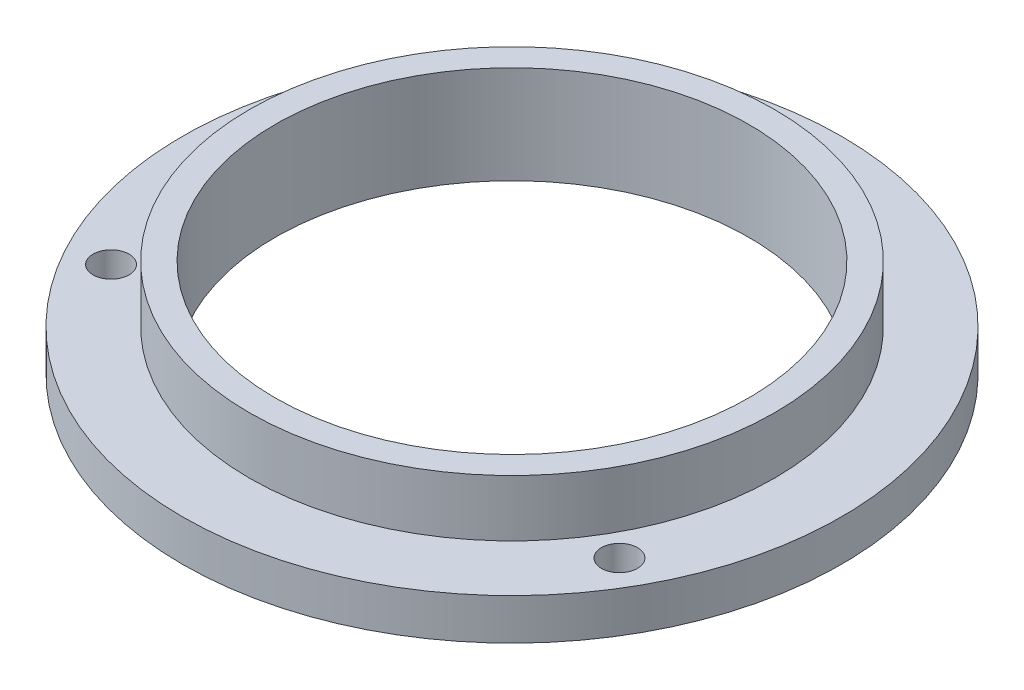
ISO-10303-21;
HEADER;
FILE_DESCRIPTION(('STEP AP214'),'2;1');
FILE_NAME('part.step','',(''),(''),'','','');
FILE_SCHEMA(('AUTOMOTIVE_DESIGN { 1 0 10303 214 1 1 1 1 }'));
ENDSEC;
DATA;
#1=APPLICATION_CONTEXT('core data for automotive mechanical design processes');
#2=APPLICATION_PROTOCOL_DEFINITION('international standard','automotive_design',2000,#1);
#3=PRODUCT_CONTEXT('',#1,'mechanical');
#4=PRODUCT('Part','Part','',(#3));
#5=PRODUCT_RELATED_PRODUCT_CATEGORY('part','',(#4));
#6=PRODUCT_DEFINITION_FORMATION('','',#4);
#7=PRODUCT_DEFINITION_CONTEXT('part definition',#1,'design');
#8=PRODUCT_DEFINITION('design','',#6,#7);
#9=PRODUCT_DEFINITION_SHAPE('','',#8);
#10=(LENGTH_UNIT() NAMED_UNIT(*) SI_UNIT(.MILLI.,.METRE.));
#11=(NAMED_UNIT(*) PLANE_ANGLE_UNIT() SI_UNIT($,.RADIAN.));
#12=(NAMED_UNIT(*) SI_UNIT($,.STERADIAN.) SOLID_ANGLE_UNIT());
#13=UNCERTAINTY_MEASURE_WITH_UNIT(LENGTH_MEASURE(1.E-05),#10,'distance_accuracy_value','');
#14=(GEOMETRIC_REPRESENTATION_CONTEXT(3) GLOBAL_UNCERTAINTY_ASSIGNED_CONTEXT((#13)) GLOBAL_UNIT_ASSIGNED_CONTEXT((#10,
#11,#12)) REPRESENTATION_CONTEXT('',''));
#15=CARTESIAN_POINT('',(0.,0.,0.));
#16=DIRECTION('',(0.,0.,1.));
#17=DIRECTION('',(1.,0.,0.));
#18=AXIS2_PLACEMENT_3D('',#15,#16,#17);
#19=CARTESIAN_POINT('',(0.,65.1723314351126,0.));
#20=DIRECTION('',(0.,1.,0.));
#21=DIRECTION('',(0.,0.,1.));
#22=AXIS2_PLACEMENT_3D('',#19,#20,#21);
#23=CYLINDRICAL_SURFACE('',#22,23.);
#24=CARTESIAN_POINT('',(0.,-4.,0.));
#25=DIRECTION('',(0.,1.,0.));
#26=DIRECTION('',(0.,0.,1.));
#27=AXIS2_PLACEMENT_3D('',#24,#25,#26);
#28=CIRCLE('',#27,23.);
#29=CARTESIAN_POINT('',(0.,-4.,23.));
#30=VERTEX_POINT('',#29);
#31=EDGE_CURVE('E10',#30,#30,#28,.T.);
#32=ORIENTED_EDGE('',*,*,#31,.F.);
#33=EDGE_LOOP('',(#32));
#34=FACE_BOUND('',#33,.T.);
#35=CARTESIAN_POINT('',(0.,5.5,0.));
#36=DIRECTION('',(0.,1.,0.));
#37=DIRECTION('',(0.,0.,1.));
#38=AXIS2_PLACEMENT_3D('',#35,#36,#37);
#39=CIRCLE('',#38,23.);
#40=CARTESIAN_POINT('',(0.,5.5,23.));
#41=VERTEX_POINT('',#40);
#42=EDGE_CURVE('E66',#41,#41,#39,.T.);
#43=ORIENTED_EDGE('',*,*,#42,.T.);
#44=EDGE_LOOP('',(#43));
#45=FACE_BOUND('',#44,.T.);
#46=ADVANCED_FACE('F39',(#34,#45),#23,.F.);
#47=CARTESIAN_POINT('',(23.,-4.,0.));
#48=DIRECTION('',(0.,1.,0.));
#49=DIRECTION('',(0.,0.,1.));
#50=AXIS2_PLACEMENT_3D('',#47,#48,#49);
#51=PLANE('',#50);
#52=CARTESIAN_POINT('',(1.9863438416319E-12,-4.,-28.5));
#53=DIRECTION('',(0.,1.,0.));
#54=DIRECTION('',(0.,0.,1.));
#55=AXIS2_PLACEMENT_3D('',#52,#53,#54);
#56=CIRCLE('',#55,1.75);
#57=CARTESIAN_POINT('',(1.9863438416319E-12,-4.,-26.75));
#58=VERTEX_POINT('',#57);
#59=EDGE_CURVE('E70',#58,#58,#56,.T.);
#60=ORIENTED_EDGE('',*,*,#59,.T.);
#61=EDGE_LOOP('',(#60));
#62=FACE_BOUND('',#61,.T.);
#63=CARTESIAN_POINT('',(24.6817240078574,-4.,14.2500000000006));
#64=DIRECTION('',(0.,1.,0.));
#65=DIRECTION('',(0.,0.,1.));
#66=AXIS2_PLACEMENT_3D('',#63,#64,#65);
#67=CIRCLE('',#66,1.75);
#68=CARTESIAN_POINT('',(24.6817240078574,-4.,16.0000000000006));
#69=VERTEX_POINT('',#68);
#70=EDGE_CURVE('E83',#69,#69,#67,.T.);
#71=ORIENTED_EDGE('',*,*,#70,.T.);
#72=EDGE_LOOP('',(#71));
#73=FACE_BOUND('',#72,.T.);
#74=CARTESIAN_POINT('',(-24.6817240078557,-4.,14.2499999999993));
#75=DIRECTION('',(0.,1.,0.));
#76=DIRECTION('',(0.,0.,1.));
#77=AXIS2_PLACEMENT_3D('',#74,#75,#76);
#78=CIRCLE('',#77,1.75);
#79=CARTESIAN_POINT('',(-24.6817240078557,-4.,15.9999999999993));
#80=VERTEX_POINT('',#79);
#81=EDGE_CURVE('E75',#80,#80,#78,.T.);
#82=ORIENTED_EDGE('',*,*,#81,.T.);
#83=EDGE_LOOP('',(#82));
#84=FACE_BOUND('',#83,.T.);
#85=CARTESIAN_POINT('',(0.,-4.,0.));
#86=DIRECTION('',(0.,1.,0.));
#87=DIRECTION('',(0.,0.,1.));
#88=AXIS2_PLACEMENT_3D('',#85,#86,#87);
#89=CIRCLE('',#88,32.);
#90=CARTESIAN_POINT('',(0.,-4.,32.));
#91=VERTEX_POINT('',#90);
#92=EDGE_CURVE('E46',#91,#91,#89,.T.);
#93=ORIENTED_EDGE('',*,*,#92,.F.);
#94=EDGE_LOOP('',(#93));
#95=FACE_BOUND('',#94,.T.);
#96=ORIENTED_EDGE('',*,*,#31,.T.);
#97=EDGE_LOOP('',(#96));
#98=FACE_BOUND('',#97,.T.);
#99=ADVANCED_FACE('F95',(#62,#73,#84,#95,#98),#51,.F.);
#100=CARTESIAN_POINT('',(0.,65.1723314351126,0.));
#101=DIRECTION('',(0.,1.,0.));
#102=DIRECTION('',(0.,0.,1.));
#103=AXIS2_PLACEMENT_3D('',#100,#101,#102);
#104=CYLINDRICAL_SURFACE('',#103,32.);
#105=CARTESIAN_POINT('',(0.,0.,0.));
#106=DIRECTION('',(0.,1.,0.));
#107=DIRECTION('',(0.,0.,1.));
#108=AXIS2_PLACEMENT_3D('',#105,#106,#107);
#109=CIRCLE('',#108,32.);
#110=CARTESIAN_POINT('',(0.,0.,32.));
#111=VERTEX_POINT('',#110);
#112=EDGE_CURVE('E51',#111,#111,#109,.T.);
#113=ORIENTED_EDGE('',*,*,#112,.F.);
#114=EDGE_LOOP('',(#113));
#115=FACE_BOUND('',#114,.T.);
#116=ORIENTED_EDGE('',*,*,#92,.T.);
#117=EDGE_LOOP('',(#116));
#118=FACE_BOUND('',#117,.T.);
#119=ADVANCED_FACE('F109',(#115,#118),#104,.T.);
#120=CARTESIAN_POINT('',(32.,0.,0.));
#121=DIRECTION('',(0.,-1.,0.));
#122=DIRECTION('',(0.,0.,-1.));
#123=AXIS2_PLACEMENT_3D('',#120,#121,#122);
#124=PLANE('',#123);
#125=CARTESIAN_POINT('',(1.9863438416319E-12,0.,-28.5));
#126=DIRECTION('',(0.,1.,0.));
#127=DIRECTION('',(0.,0.,1.));
#128=AXIS2_PLACEMENT_3D('',#125,#126,#127);
#129=CIRCLE('',#128,1.75);
#130=CARTESIAN_POINT('',(1.9863438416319E-12,0.,-26.75));
#131=VERTEX_POINT('',#130);
#132=EDGE_CURVE('E87',#131,#131,#129,.T.);
#133=ORIENTED_EDGE('',*,*,#132,.F.);
#134=EDGE_LOOP('',(#133));
#135=FACE_BOUND('',#134,.T.);
#136=CARTESIAN_POINT('',(24.6817240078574,0.,14.2500000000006));
#137=DIRECTION('',(0.,1.,0.));
#138=DIRECTION('',(0.,0.,1.));
#139=AXIS2_PLACEMENT_3D('',#136,#137,#138);
#140=CIRCLE('',#139,1.75);
#141=CARTESIAN_POINT('',(24.6817240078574,0.,16.0000000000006));
#142=VERTEX_POINT('',#141);
#143=EDGE_CURVE('E79',#142,#142,#140,.T.);
#144=ORIENTED_EDGE('',*,*,#143,.F.);
#145=EDGE_LOOP('',(#144));
#146=FACE_BOUND('',#145,.T.);
#147=CARTESIAN_POINT('',(-24.6817240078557,0.,14.2499999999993));
#148=DIRECTION('',(0.,1.,0.));
#149=DIRECTION('',(0.,0.,1.));
#150=AXIS2_PLACEMENT_3D('',#147,#148,#149);
#151=CIRCLE('',#150,1.75);
#152=CARTESIAN_POINT('',(-24.6817240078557,0.,15.9999999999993));
#153=VERTEX_POINT('',#152);
#154=EDGE_CURVE('E71',#153,#153,#151,.T.);
#155=ORIENTED_EDGE('',*,*,#154,.F.);
#156=EDGE_LOOP('',(#155));
#157=FACE_BOUND('',#156,.T.);
#158=CARTESIAN_POINT('',(0.,0.,0.));
#159=DIRECTION('',(0.,1.,0.));
#160=DIRECTION('',(0.,0.,1.));
#161=AXIS2_PLACEMENT_3D('',#158,#159,#160);
#162=CIRCLE('',#161,25.5);
#163=CARTESIAN_POINT('',(0.,0.,25.5));
#164=VERTEX_POINT('',#163);
#165=EDGE_CURVE('E56',#164,#164,#162,.T.);
#166=ORIENTED_EDGE('',*,*,#165,.F.);
#167=EDGE_LOOP('',(#166));
#168=FACE_BOUND('',#167,.T.);
#169=ORIENTED_EDGE('',*,*,#112,.T.);
#170=EDGE_LOOP('',(#169));
#171=FACE_BOUND('',#170,.T.);
#172=ADVANCED_FACE('F105',(#135,#146,#157,#168,#171),#124,.F.);
#173=CARTESIAN_POINT('',(0.,65.1723314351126,0.));
#174=DIRECTION('',(0.,1.,0.));
#175=DIRECTION('',(0.,0.,1.));
#176=AXIS2_PLACEMENT_3D('',#173,#174,#175);
#177=CYLINDRICAL_SURFACE('',#176,25.5);
#178=CARTESIAN_POINT('',(0.,5.5,0.));
#179=DIRECTION('',(0.,1.,0.));
#180=DIRECTION('',(0.,0.,1.));
#181=AXIS2_PLACEMENT_3D('',#178,#179,#180);
#182=CIRCLE('',#181,25.5);
#183=CARTESIAN_POINT('',(0.,5.5,25.5));
#184=VERTEX_POINT('',#183);
#185=EDGE_CURVE('E62',#184,#184,#182,.T.);
#186=ORIENTED_EDGE('',*,*,#185,.F.);
#187=EDGE_LOOP('',(#186));
#188=FACE_BOUND('',#187,.T.);
#189=ORIENTED_EDGE('',*,*,#165,.T.);
#190=EDGE_LOOP('',(#189));
#191=FACE_BOUND('',#190,.T.);
#192=ADVANCED_FACE('F108',(#188,#191),#177,.T.);
#193=CARTESIAN_POINT('',(25.5,5.5,0.));
#194=DIRECTION('',(0.,-1.,0.));
#195=DIRECTION('',(0.,0.,-1.));
#196=AXIS2_PLACEMENT_3D('',#193,#194,#195);
#197=PLANE('',#196);
#198=ORIENTED_EDGE('',*,*,#42,.F.);
#199=EDGE_LOOP('',(#198));
#200=FACE_BOUND('',#199,.T.);
#201=ORIENTED_EDGE('',*,*,#185,.T.);
#202=EDGE_LOOP('',(#201));
#203=FACE_BOUND('',#202,.T.);
#204=ADVANCED_FACE('F131',(#200,#203),#197,.F.);
#205=CARTESIAN_POINT('',(-24.6817240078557,-4.,14.2499999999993));
#206=DIRECTION('',(0.,1.,0.));
#207=DIRECTION('',(0.,0.,1.));
#208=AXIS2_PLACEMENT_3D('',#205,#206,#207);
#209=CYLINDRICAL_SURFACE('',#208,1.75);
#210=ORIENTED_EDGE('',*,*,#81,.F.);
#211=EDGE_LOOP('',(#210));
#212=FACE_BOUND('',#211,.T.);
#213=ORIENTED_EDGE('',*,*,#154,.T.);
#214=EDGE_LOOP('',(#213));
#215=FACE_BOUND('',#214,.T.);
#216=ADVANCED_FACE('F134',(#212,#215),#209,.F.);
#217=CARTESIAN_POINT('',(24.6817240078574,-4.,14.2500000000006));
#218=DIRECTION('',(0.,1.,0.));
#219=DIRECTION('',(0.,0.,1.));
#220=AXIS2_PLACEMENT_3D('',#217,#218,#219);
#221=CYLINDRICAL_SURFACE('',#220,1.75);
#222=ORIENTED_EDGE('',*,*,#70,.F.);
#223=EDGE_LOOP('',(#222));
#224=FACE_BOUND('',#223,.T.);
#225=ORIENTED_EDGE('',*,*,#143,.T.);
#226=EDGE_LOOP('',(#225));
#227=FACE_BOUND('',#226,.T.);
#228=ADVANCED_FACE('F101',(#224,#227),#221,.F.);
#229=CARTESIAN_POINT('',(1.9863438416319E-12,-4.,-28.5));
#230=DIRECTION('',(0.,1.,0.));
#231=DIRECTION('',(0.,0.,1.));
#232=AXIS2_PLACEMENT_3D('',#229,#230,#231);
#233=CYLINDRICAL_SURFACE('',#232,1.75);
#234=ORIENTED_EDGE('',*,*,#59,.F.);
#235=EDGE_LOOP('',(#234));
#236=FACE_BOUND('',#235,.T.);
#237=ORIENTED_EDGE('',*,*,#132,.T.);
#238=EDGE_LOOP('',(#237));
#239=FACE_BOUND('',#238,.T.);
#240=ADVANCED_FACE('F98',(#236,#239),#233,.F.);
#241=CLOSED_SHELL('',(#46,#99,#119,#172,#192,#204,#216,#228,#240));
#242=MANIFOLD_SOLID_BREP('B2',#241);
#243=ADVANCED_BREP_SHAPE_REPRESENTATION('',(#18,#242),#14);
#244=SHAPE_DEFINITION_REPRESENTATION(#9,#243);
ENDSEC;
END-ISO-10303-21;
